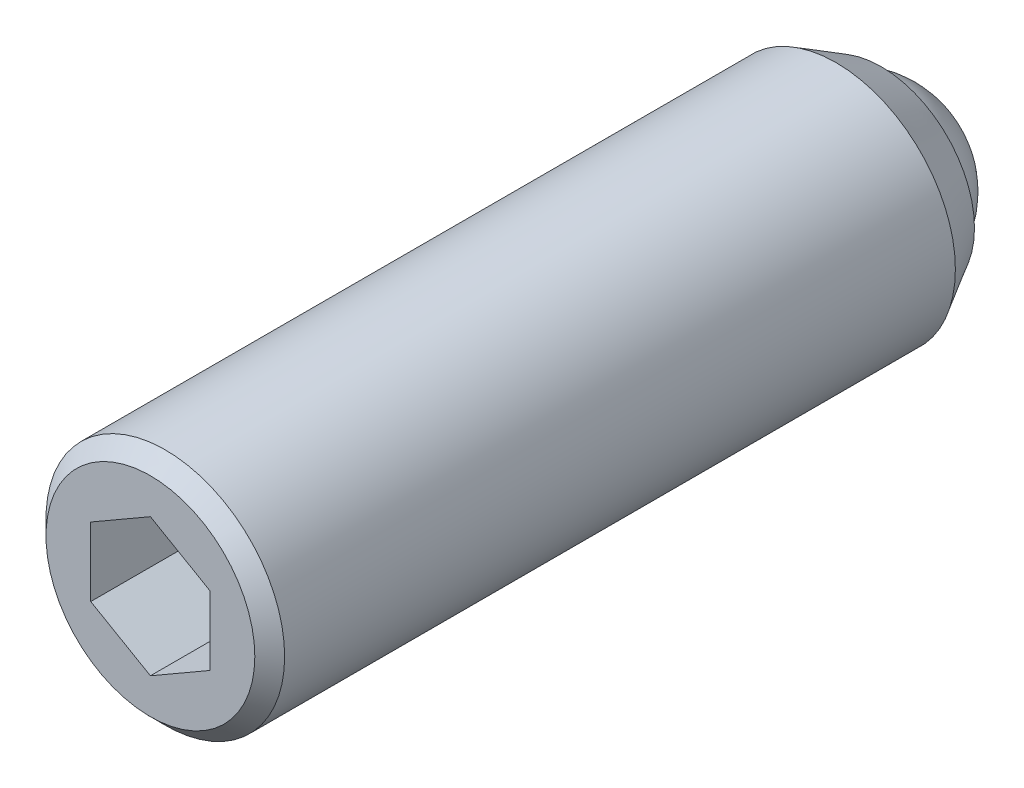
ISO-10303-21;
HEADER;
FILE_DESCRIPTION(('STEP AP214'),'2;1');
FILE_NAME('part.step','',(''),(''),'','','');
FILE_SCHEMA(('AUTOMOTIVE_DESIGN { 1 0 10303 214 1 1 1 1 }'));
ENDSEC;
DATA;
#1=APPLICATION_CONTEXT('core data for automotive mechanical design processes');
#2=APPLICATION_PROTOCOL_DEFINITION('international standard','automotive_design',2000,#1);
#3=PRODUCT_CONTEXT('',#1,'mechanical');
#4=PRODUCT('Part','Part','',(#3));
#5=PRODUCT_RELATED_PRODUCT_CATEGORY('part','',(#4));
#6=PRODUCT_DEFINITION_FORMATION('','',#4);
#7=PRODUCT_DEFINITION_CONTEXT('part definition',#1,'design');
#8=PRODUCT_DEFINITION('design','',#6,#7);
#9=PRODUCT_DEFINITION_SHAPE('','',#8);
#10=(LENGTH_UNIT() NAMED_UNIT(*) SI_UNIT(.MILLI.,.METRE.));
#11=(NAMED_UNIT(*) PLANE_ANGLE_UNIT() SI_UNIT($,.RADIAN.));
#12=(NAMED_UNIT(*) SI_UNIT($,.STERADIAN.) SOLID_ANGLE_UNIT());
#13=UNCERTAINTY_MEASURE_WITH_UNIT(LENGTH_MEASURE(1.E-05),#10,'distance_accuracy_value','');
#14=(GEOMETRIC_REPRESENTATION_CONTEXT(3) GLOBAL_UNCERTAINTY_ASSIGNED_CONTEXT((#13)) GLOBAL_UNIT_ASSIGNED_CONTEXT((#10,
#11,#12)) REPRESENTATION_CONTEXT('',''));
#15=CARTESIAN_POINT('',(0.,0.,0.));
#16=DIRECTION('',(0.,0.,1.));
#17=DIRECTION('',(1.,0.,0.));
#18=AXIS2_PLACEMENT_3D('',#15,#16,#17);
#19=CARTESIAN_POINT('',(4.,2.30940107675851,50.5));
#20=DIRECTION('',(0.5,0.86602540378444,0.));
#21=DIRECTION('',(0.86602540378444,-0.5,0.));
#22=AXIS2_PLACEMENT_3D('',#19,#20,#21);
#23=PLANE('',#22);
#24=DIRECTION('',(0.,0.,1.));
#25=VECTOR('',#24,1.);
#26=CARTESIAN_POINT('',(4.,2.30940107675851,50.5));
#27=LINE('',#26,#25);
#28=CARTESIAN_POINT('',(4.,2.30940107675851,47.));
#29=VERTEX_POINT('',#28);
#30=CARTESIAN_POINT('',(4.,2.30940107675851,53.));
#31=VERTEX_POINT('',#30);
#32=EDGE_CURVE('E68',#29,#31,#27,.T.);
#33=ORIENTED_EDGE('',*,*,#32,.T.);
#34=DIRECTION('',(-0.86602540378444,0.5,0.));
#35=VECTOR('',#34,1.);
#36=CARTESIAN_POINT('',(4.,2.30940107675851,53.));
#37=LINE('',#36,#35);
#38=CARTESIAN_POINT('',(0.,4.618802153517,53.));
#39=VERTEX_POINT('',#38);
#40=EDGE_CURVE('E29',#31,#39,#37,.T.);
#41=ORIENTED_EDGE('',*,*,#40,.T.);
#42=DIRECTION('',(0.,0.,1.));
#43=VECTOR('',#42,1.);
#44=CARTESIAN_POINT('',(0.,4.618802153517,50.5));
#45=LINE('',#44,#43);
#46=CARTESIAN_POINT('',(0.,4.618802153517,47.));
#47=VERTEX_POINT('',#46);
#48=EDGE_CURVE('E80',#47,#39,#45,.T.);
#49=ORIENTED_EDGE('',*,*,#48,.F.);
#50=DIRECTION('',(-0.86602540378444,0.5,0.));
#51=VECTOR('',#50,1.);
#52=CARTESIAN_POINT('',(4.,2.30940107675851,47.));
#53=LINE('',#52,#51);
#54=EDGE_CURVE('E79',#29,#47,#53,.T.);
#55=ORIENTED_EDGE('',*,*,#54,.F.);
#56=EDGE_LOOP('',(#33,#41,#49,#55));
#57=FACE_BOUND('',#56,.T.);
#58=ADVANCED_FACE('F14',(#57),#23,.F.);
#59=CARTESIAN_POINT('',(4.,-2.30940107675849,50.5));
#60=DIRECTION('',(1.,0.,0.));
#61=DIRECTION('',(0.,-1.,0.));
#62=AXIS2_PLACEMENT_3D('',#59,#60,#61);
#63=PLANE('',#62);
#64=DIRECTION('',(0.,0.,1.));
#65=VECTOR('',#64,1.);
#66=CARTESIAN_POINT('',(4.,-2.30940107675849,50.5));
#67=LINE('',#66,#65);
#68=CARTESIAN_POINT('',(4.,-2.30940107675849,47.));
#69=VERTEX_POINT('',#68);
#70=CARTESIAN_POINT('',(4.,-2.30940107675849,53.));
#71=VERTEX_POINT('',#70);
#72=EDGE_CURVE('E76',#69,#71,#67,.T.);
#73=ORIENTED_EDGE('',*,*,#72,.T.);
#74=DIRECTION('',(0.,1.,0.));
#75=VECTOR('',#74,1.);
#76=CARTESIAN_POINT('',(4.,-2.30940107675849,53.));
#77=LINE('',#76,#75);
#78=EDGE_CURVE('E75',#71,#31,#77,.T.);
#79=ORIENTED_EDGE('',*,*,#78,.T.);
#80=ORIENTED_EDGE('',*,*,#32,.F.);
#81=DIRECTION('',(0.,1.,0.));
#82=VECTOR('',#81,1.);
#83=CARTESIAN_POINT('',(4.,-2.30940107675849,47.));
#84=LINE('',#83,#82);
#85=EDGE_CURVE('E72',#69,#29,#84,.T.);
#86=ORIENTED_EDGE('',*,*,#85,.F.);
#87=EDGE_LOOP('',(#73,#79,#80,#86));
#88=FACE_BOUND('',#87,.T.);
#89=ADVANCED_FACE('F70',(#88),#63,.F.);
#90=CARTESIAN_POINT('',(4.,-2.30940107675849,50.5));
#91=DIRECTION('',(-0.5,0.866025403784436,0.));
#92=DIRECTION('',(0.866025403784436,0.5,0.));
#93=AXIS2_PLACEMENT_3D('',#90,#91,#92);
#94=PLANE('',#93);
#95=DIRECTION('',(0.,0.,1.));
#96=VECTOR('',#95,1.);
#97=CARTESIAN_POINT('',(0.,-4.61880215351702,50.5));
#98=LINE('',#97,#96);
#99=CARTESIAN_POINT('',(0.,-4.61880215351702,47.));
#100=VERTEX_POINT('',#99);
#101=CARTESIAN_POINT('',(0.,-4.61880215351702,53.));
#102=VERTEX_POINT('',#101);
#103=EDGE_CURVE('E122',#100,#102,#98,.T.);
#104=ORIENTED_EDGE('',*,*,#103,.T.);
#105=DIRECTION('',(-0.866025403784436,-0.5,0.));
#106=VECTOR('',#105,1.);
#107=CARTESIAN_POINT('',(4.,-2.30940107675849,53.));
#108=LINE('',#107,#106);
#109=EDGE_CURVE('E113',#71,#102,#108,.T.);
#110=ORIENTED_EDGE('',*,*,#109,.F.);
#111=ORIENTED_EDGE('',*,*,#72,.F.);
#112=DIRECTION('',(0.866025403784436,0.5,0.));
#113=VECTOR('',#112,1.);
#114=CARTESIAN_POINT('',(0.,-4.61880215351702,47.));
#115=LINE('',#114,#113);
#116=EDGE_CURVE('E89',#100,#69,#115,.T.);
#117=ORIENTED_EDGE('',*,*,#116,.F.);
#118=EDGE_LOOP('',(#104,#110,#111,#117));
#119=FACE_BOUND('',#118,.T.);
#120=ADVANCED_FACE('F147',(#119),#94,.T.);
#121=CARTESIAN_POINT('',(-4.,-2.30940107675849,50.5));
#122=DIRECTION('',(-0.5,-0.866025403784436,0.));
#123=DIRECTION('',(-0.866025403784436,0.5,0.));
#124=AXIS2_PLACEMENT_3D('',#121,#122,#123);
#125=PLANE('',#124);
#126=DIRECTION('',(0.,0.,1.));
#127=VECTOR('',#126,1.);
#128=CARTESIAN_POINT('',(-4.,-2.30940107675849,50.5));
#129=LINE('',#128,#127);
#130=CARTESIAN_POINT('',(-4.,-2.30940107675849,47.));
#131=VERTEX_POINT('',#130);
#132=CARTESIAN_POINT('',(-4.,-2.30940107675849,53.));
#133=VERTEX_POINT('',#132);
#134=EDGE_CURVE('E120',#131,#133,#129,.T.);
#135=ORIENTED_EDGE('',*,*,#134,.T.);
#136=DIRECTION('',(0.866025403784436,-0.5,0.));
#137=VECTOR('',#136,1.);
#138=CARTESIAN_POINT('',(-4.,-2.30940107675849,53.));
#139=LINE('',#138,#137);
#140=EDGE_CURVE('E111',#133,#102,#139,.T.);
#141=ORIENTED_EDGE('',*,*,#140,.T.);
#142=ORIENTED_EDGE('',*,*,#103,.F.);
#143=DIRECTION('',(0.866025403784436,-0.5,0.));
#144=VECTOR('',#143,1.);
#145=CARTESIAN_POINT('',(-4.,-2.30940107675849,47.));
#146=LINE('',#145,#144);
#147=EDGE_CURVE('E101',#131,#100,#146,.T.);
#148=ORIENTED_EDGE('',*,*,#147,.F.);
#149=EDGE_LOOP('',(#135,#141,#142,#148));
#150=FACE_BOUND('',#149,.T.);
#151=ADVANCED_FACE('F157',(#150),#125,.F.);
#152=CARTESIAN_POINT('',(-4.,-2.30940107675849,50.5));
#153=DIRECTION('',(1.,0.,0.));
#154=DIRECTION('',(0.,-1.,0.));
#155=AXIS2_PLACEMENT_3D('',#152,#153,#154);
#156=PLANE('',#155);
#157=DIRECTION('',(0.,0.,1.));
#158=VECTOR('',#157,1.);
#159=CARTESIAN_POINT('',(-4.,2.30940107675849,50.5));
#160=LINE('',#159,#158);
#161=CARTESIAN_POINT('',(-4.,2.30940107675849,47.));
#162=VERTEX_POINT('',#161);
#163=CARTESIAN_POINT('',(-4.,2.30940107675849,53.));
#164=VERTEX_POINT('',#163);
#165=EDGE_CURVE('E37',#162,#164,#160,.T.);
#166=ORIENTED_EDGE('',*,*,#165,.T.);
#167=DIRECTION('',(0.,1.,0.));
#168=VECTOR('',#167,1.);
#169=CARTESIAN_POINT('',(-4.,-2.30940107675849,53.));
#170=LINE('',#169,#168);
#171=EDGE_CURVE('E108',#133,#164,#170,.T.);
#172=ORIENTED_EDGE('',*,*,#171,.F.);
#173=ORIENTED_EDGE('',*,*,#134,.F.);
#174=DIRECTION('',(0.,-1.,0.));
#175=VECTOR('',#174,1.);
#176=CARTESIAN_POINT('',(-4.,2.30940107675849,47.));
#177=LINE('',#176,#175);
#178=EDGE_CURVE('E98',#162,#131,#177,.T.);
#179=ORIENTED_EDGE('',*,*,#178,.F.);
#180=EDGE_LOOP('',(#166,#172,#173,#179));
#181=FACE_BOUND('',#180,.T.);
#182=ADVANCED_FACE('F153',(#181),#156,.T.);
#183=CARTESIAN_POINT('',(-4.,2.30940107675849,50.5));
#184=DIRECTION('',(0.5,-0.866025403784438,0.));
#185=DIRECTION('',(-0.866025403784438,-0.5,0.));
#186=AXIS2_PLACEMENT_3D('',#183,#184,#185);
#187=PLANE('',#186);
#188=ORIENTED_EDGE('',*,*,#165,.F.);
#189=DIRECTION('',(-0.866025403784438,-0.5,0.));
#190=VECTOR('',#189,1.);
#191=CARTESIAN_POINT('',(0.,4.618802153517,47.));
#192=LINE('',#191,#190);
#193=EDGE_CURVE('E84',#47,#162,#192,.T.);
#194=ORIENTED_EDGE('',*,*,#193,.F.);
#195=ORIENTED_EDGE('',*,*,#48,.T.);
#196=DIRECTION('',(0.866025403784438,0.5,0.));
#197=VECTOR('',#196,1.);
#198=CARTESIAN_POINT('',(-4.,2.30940107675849,53.));
#199=LINE('',#198,#197);
#200=EDGE_CURVE('E105',#164,#39,#199,.T.);
#201=ORIENTED_EDGE('',*,*,#200,.F.);
#202=EDGE_LOOP('',(#188,#194,#195,#201));
#203=FACE_BOUND('',#202,.T.);
#204=ADVANCED_FACE('F150',(#203),#187,.T.);
#205=CARTESIAN_POINT('',(0.,0.,52.75));
#206=DIRECTION('',(0.,0.,-1.));
#207=DIRECTION('',(1.,0.,0.));
#208=AXIS2_PLACEMENT_3D('',#205,#206,#207);
#209=CYLINDRICAL_SURFACE('',#208,8.);
#210=CARTESIAN_POINT('',(0.,0.,52.));
#211=DIRECTION('',(0.,0.,-1.));
#212=DIRECTION('',(1.,0.,0.));
#213=AXIS2_PLACEMENT_3D('',#210,#211,#212);
#214=CIRCLE('',#213,8.);
#215=CARTESIAN_POINT('',(8.,0.,52.));
#216=VERTEX_POINT('',#215);
#217=EDGE_CURVE('E9',#216,#216,#214,.T.);
#218=ORIENTED_EDGE('',*,*,#217,.T.);
#219=EDGE_LOOP('',(#218));
#220=FACE_BOUND('',#219,.T.);
#221=CARTESIAN_POINT('',(0.,0.,7.03108891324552));
#222=DIRECTION('',(0.,0.,-1.));
#223=DIRECTION('',(-1.,0.,0.));
#224=AXIS2_PLACEMENT_3D('',#221,#222,#223);
#225=CIRCLE('',#224,8.);
#226=CARTESIAN_POINT('',(-8.,0.,7.03108891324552));
#227=VERTEX_POINT('',#226);
#228=EDGE_CURVE('E244',#227,#227,#225,.T.);
#229=ORIENTED_EDGE('',*,*,#228,.F.);
#230=EDGE_LOOP('',(#229));
#231=FACE_BOUND('',#230,.T.);
#232=ADVANCED_FACE('F16',(#220,#231),#209,.T.);
#233=CARTESIAN_POINT('',(0.,0.,52.));
#234=DIRECTION('',(0.,0.,-1.));
#235=DIRECTION('',(1.,0.,0.));
#236=AXIS2_PLACEMENT_3D('',#233,#234,#235);
#237=CONICAL_SURFACE('',#236,8.,0.785398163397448);
#238=CARTESIAN_POINT('',(0.,0.,53.));
#239=DIRECTION('',(0.,0.,-1.));
#240=DIRECTION('',(1.,0.,0.));
#241=AXIS2_PLACEMENT_3D('',#238,#239,#240);
#242=CIRCLE('',#241,7.);
#243=CARTESIAN_POINT('',(7.,0.,53.));
#244=VERTEX_POINT('',#243);
#245=EDGE_CURVE('E22',#244,#244,#242,.T.);
#246=ORIENTED_EDGE('',*,*,#245,.T.);
#247=EDGE_LOOP('',(#246));
#248=FACE_BOUND('',#247,.T.);
#249=ORIENTED_EDGE('',*,*,#217,.F.);
#250=EDGE_LOOP('',(#249));
#251=FACE_BOUND('',#250,.T.);
#252=ADVANCED_FACE('F127',(#248,#251),#237,.T.);
#253=CARTESIAN_POINT('',(0.,0.,53.));
#254=DIRECTION('',(0.,0.,-1.));
#255=DIRECTION('',(1.,0.,0.));
#256=AXIS2_PLACEMENT_3D('',#253,#254,#255);
#257=PLANE('',#256);
#258=ORIENTED_EDGE('',*,*,#200,.T.);
#259=ORIENTED_EDGE('',*,*,#40,.F.);
#260=ORIENTED_EDGE('',*,*,#78,.F.);
#261=ORIENTED_EDGE('',*,*,#109,.T.);
#262=ORIENTED_EDGE('',*,*,#140,.F.);
#263=ORIENTED_EDGE('',*,*,#171,.T.);
#264=EDGE_LOOP('',(#258,#259,#260,#261,#262,#263));
#265=FACE_BOUND('',#264,.T.);
#266=ORIENTED_EDGE('',*,*,#245,.F.);
#267=EDGE_LOOP('',(#266));
#268=FACE_BOUND('',#267,.T.);
#269=ADVANCED_FACE('F130',(#265,#268),#257,.F.);
#270=CARTESIAN_POINT('',(4.,2.30940107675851,47.));
#271=DIRECTION('',(0.,0.,1.));
#272=DIRECTION('',(1.,0.,0.));
#273=AXIS2_PLACEMENT_3D('',#270,#271,#272);
#274=PLANE('',#273);
#275=ORIENTED_EDGE('',*,*,#85,.T.);
#276=ORIENTED_EDGE('',*,*,#54,.T.);
#277=ORIENTED_EDGE('',*,*,#193,.T.);
#278=ORIENTED_EDGE('',*,*,#178,.T.);
#279=ORIENTED_EDGE('',*,*,#147,.T.);
#280=ORIENTED_EDGE('',*,*,#116,.T.);
#281=EDGE_LOOP('',(#275,#276,#277,#278,#279,#280));
#282=FACE_BOUND('',#281,.T.);
#283=ADVANCED_FACE('F86',(#282),#274,.T.);
#284=CARTESIAN_POINT('',(0.,0.,6.));
#285=DIRECTION('',(0.,0.,-1.));
#286=DIRECTION('',(-1.,0.,0.));
#287=AXIS2_PLACEMENT_3D('',#284,#285,#286);
#288=SPHERICAL_SURFACE('',#287,6.);
#289=CARTESIAN_POINT('',(0.,0.,4.));
#290=DIRECTION('',(0.,0.,-1.));
#291=DIRECTION('',(-1.,0.,0.));
#292=AXIS2_PLACEMENT_3D('',#289,#290,#291);
#293=CIRCLE('',#292,5.65685424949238);
#294=CARTESIAN_POINT('',(-5.65685424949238,0.,4.));
#295=VERTEX_POINT('',#294);
#296=EDGE_CURVE('E90',#295,#295,#293,.T.);
#297=ORIENTED_EDGE('',*,*,#296,.T.);
#298=EDGE_LOOP('',(#297));
#299=FACE_BOUND('',#298,.T.);
#300=ADVANCED_FACE('F139',(#299),#288,.T.);
#301=CARTESIAN_POINT('',(-5.65685424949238,0.,4.));
#302=DIRECTION('',(0.,0.,-1.));
#303=DIRECTION('',(-1.,0.,0.));
#304=AXIS2_PLACEMENT_3D('',#301,#302,#303);
#305=PLANE('',#304);
#306=CARTESIAN_POINT('',(0.,0.,4.));
#307=DIRECTION('',(0.,0.,-1.));
#308=DIRECTION('',(-1.,0.,0.));
#309=AXIS2_PLACEMENT_3D('',#306,#307,#308);
#310=CIRCLE('',#309,6.25);
#311=CARTESIAN_POINT('',(-6.25,0.,4.));
#312=VERTEX_POINT('',#311);
#313=EDGE_CURVE('E93',#312,#312,#310,.T.);
#314=ORIENTED_EDGE('',*,*,#313,.T.);
#315=EDGE_LOOP('',(#314));
#316=FACE_BOUND('',#315,.T.);
#317=ORIENTED_EDGE('',*,*,#296,.F.);
#318=EDGE_LOOP('',(#317));
#319=FACE_BOUND('',#318,.T.);
#320=ADVANCED_FACE('F216',(#316,#319),#305,.T.);
#321=CARTESIAN_POINT('',(0.,0.,4.));
#322=DIRECTION('',(0.,0.,1.));
#323=DIRECTION('',(1.,0.,0.));
#324=AXIS2_PLACEMENT_3D('',#321,#322,#323);
#325=CONICAL_SURFACE('',#324,6.25,0.523598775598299);
#326=ORIENTED_EDGE('',*,*,#228,.T.);
#327=EDGE_LOOP('',(#326));
#328=FACE_BOUND('',#327,.T.);
#329=ORIENTED_EDGE('',*,*,#313,.F.);
#330=EDGE_LOOP('',(#329));
#331=FACE_BOUND('',#330,.T.);
#332=ADVANCED_FACE('F225',(#328,#331),#325,.T.);
#333=CLOSED_SHELL('',(#58,#89,#120,#151,#182,#204,#232,#252,#269,#283,#300,#320,#332));
#334=MANIFOLD_SOLID_BREP('B1',#333);
#335=ADVANCED_BREP_SHAPE_REPRESENTATION('',(#18,#334),#14);
#336=SHAPE_DEFINITION_REPRESENTATION(#9,#335);
ENDSEC;
END-ISO-10303-21;
